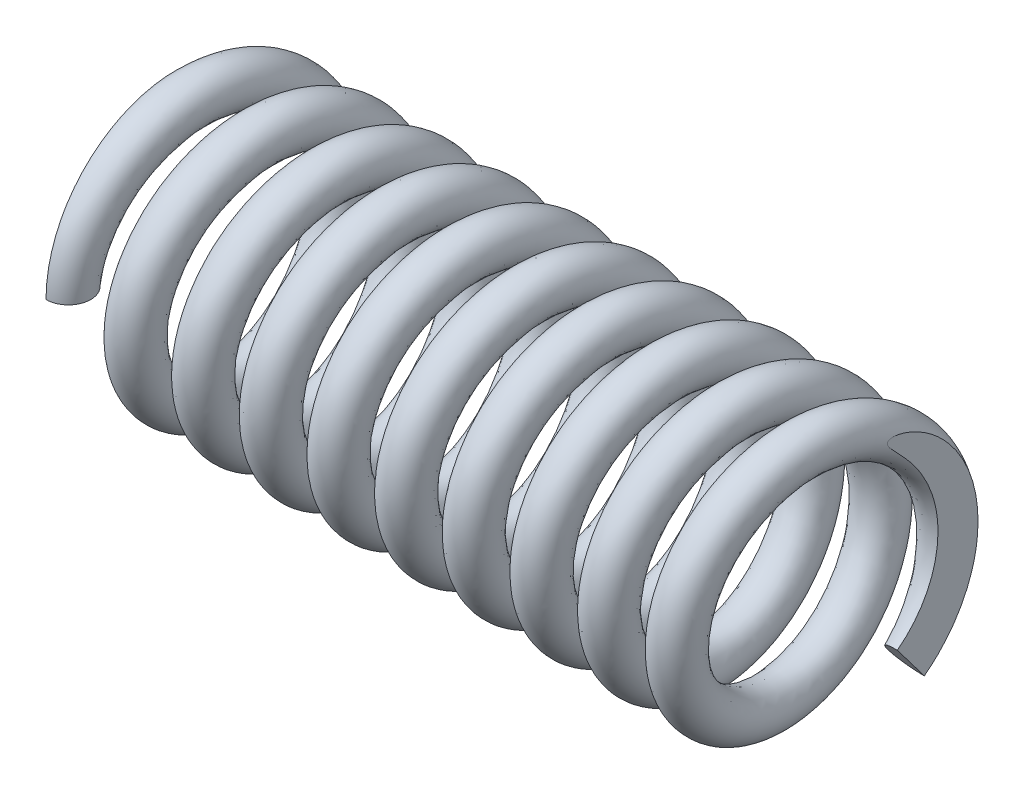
from build123d import *

# Parameters (mm, degrees)
SWEEP1_PITCH       = 1.7272
SWEEP1_HEIGHT      = 16.6624
SWEEP1_RADIUS      = 3.0226
SKETCH2_R          = 0.5715
SKETCH3_R          = 3.81
CUT_EXTRUDE1_DEPTH = 2.54
CUT_EXTRUDE2_START = 16.6624
SKETCH3_2_R        = 3.81
CUT_EXTRUDE2_DEPTH = 2.54


with BuildPart() as part:
    # Sweep1: sweep along a helix
    with BuildLine() as sweep1_path:
        Helix(SWEEP1_PITCH, SWEEP1_HEIGHT, SWEEP1_RADIUS, center=(0, 0, 0), direction=(1, 0, 0), lefthand=True)
    # Sketch2 → Sweep1 (sweep)
    with BuildSketch(Plane(origin=(0, 0, 0), x_dir=(1, 0, 0), z_dir=(0, 1, 0))):
        with Locations((0, -3.0226)):
            Circle(SKETCH2_R)
    sweep(path=sweep1_path.line, is_frenet=True)

    # Sketch3 → Cut-Extrude1 (cut)
    with BuildSketch(Plane(origin=(0, 0, 0), x_dir=(0, 0, -1), z_dir=(1, 0, 0))):
        Circle(SKETCH3_R)
    extrude(amount=-CUT_EXTRUDE1_DEPTH, mode=Mode.SUBTRACT)

    # Sketch3_2 → Cut-Extrude2 (cut)
    with BuildSketch(Plane(origin=(0, 0, 0), x_dir=(0, 0, -1), z_dir=(1, 0, 0)).offset(CUT_EXTRUDE2_START)):
        Circle(SKETCH3_2_R)
    extrude(amount=CUT_EXTRUDE2_DEPTH, mode=Mode.SUBTRACT)


solid = part.part
